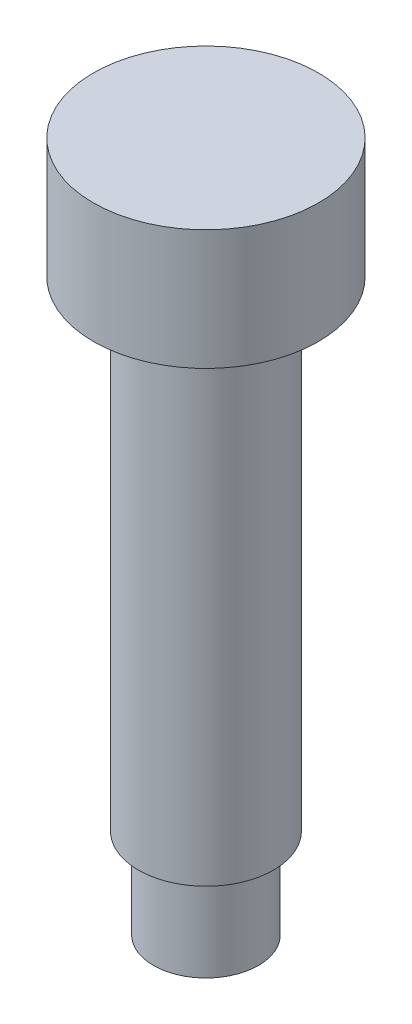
ISO-10303-21;
HEADER;
FILE_DESCRIPTION(('STEP AP214'),'2;1');
FILE_NAME('part.step','',(''),(''),'','','');
FILE_SCHEMA(('AUTOMOTIVE_DESIGN { 1 0 10303 214 1 1 1 1 }'));
ENDSEC;
DATA;
#1=APPLICATION_CONTEXT('core data for automotive mechanical design processes');
#2=APPLICATION_PROTOCOL_DEFINITION('international standard','automotive_design',2000,#1);
#3=PRODUCT_CONTEXT('',#1,'mechanical');
#4=PRODUCT('Part','Part','',(#3));
#5=PRODUCT_RELATED_PRODUCT_CATEGORY('part','',(#4));
#6=PRODUCT_DEFINITION_FORMATION('','',#4);
#7=PRODUCT_DEFINITION_CONTEXT('part definition',#1,'design');
#8=PRODUCT_DEFINITION('design','',#6,#7);
#9=PRODUCT_DEFINITION_SHAPE('','',#8);
#10=(LENGTH_UNIT() NAMED_UNIT(*) SI_UNIT(.MILLI.,.METRE.));
#11=(NAMED_UNIT(*) PLANE_ANGLE_UNIT() SI_UNIT($,.RADIAN.));
#12=(NAMED_UNIT(*) SI_UNIT($,.STERADIAN.) SOLID_ANGLE_UNIT());
#13=UNCERTAINTY_MEASURE_WITH_UNIT(LENGTH_MEASURE(1.E-05),#10,'distance_accuracy_value','');
#14=(GEOMETRIC_REPRESENTATION_CONTEXT(3) GLOBAL_UNCERTAINTY_ASSIGNED_CONTEXT((#13)) GLOBAL_UNIT_ASSIGNED_CONTEXT((#10,
#11,#12)) REPRESENTATION_CONTEXT('',''));
#15=CARTESIAN_POINT('',(0.,0.,0.));
#16=DIRECTION('',(0.,0.,1.));
#17=DIRECTION('',(1.,0.,0.));
#18=AXIS2_PLACEMENT_3D('',#15,#16,#17);
#19=CARTESIAN_POINT('',(1.3890625,0.,0.));
#20=DIRECTION('',(0.,1.,0.));
#21=DIRECTION('',(0.,0.,1.));
#22=AXIS2_PLACEMENT_3D('',#19,#20,#21);
#23=PLANE('',#22);
#24=CARTESIAN_POINT('',(0.,0.,0.));
#25=DIRECTION('',(0.,1.,0.));
#26=DIRECTION('',(0.,0.,1.));
#27=AXIS2_PLACEMENT_3D('',#24,#25,#26);
#28=CIRCLE('',#27,1.3890625);
#29=CARTESIAN_POINT('',(0.,0.,1.3890625));
#30=VERTEX_POINT('',#29);
#31=EDGE_CURVE('E50',#30,#30,#28,.T.);
#32=ORIENTED_EDGE('',*,*,#31,.F.);
#33=EDGE_LOOP('',(#32));
#34=FACE_BOUND('',#33,.T.);
#35=ADVANCED_FACE('F28',(#34),#23,.F.);
#36=CARTESIAN_POINT('',(0.,18.25625,0.));
#37=DIRECTION('',(0.,-1.,0.));
#38=DIRECTION('',(0.,0.,-1.));
#39=AXIS2_PLACEMENT_3D('',#36,#37,#38);
#40=PLANE('',#39);
#41=CARTESIAN_POINT('',(0.,18.25625,0.));
#42=DIRECTION('',(0.,1.,0.));
#43=DIRECTION('',(0.,0.,1.));
#44=AXIS2_PLACEMENT_3D('',#41,#42,#43);
#45=CIRCLE('',#44,2.9765625);
#46=CARTESIAN_POINT('',(0.,18.25625,2.9765625));
#47=VERTEX_POINT('',#46);
#48=EDGE_CURVE('E10',#47,#47,#45,.T.);
#49=ORIENTED_EDGE('',*,*,#48,.T.);
#50=EDGE_LOOP('',(#49));
#51=FACE_BOUND('',#50,.T.);
#52=ADVANCED_FACE('F57',(#51),#40,.F.);
#53=CARTESIAN_POINT('',(0.,0.,0.));
#54=DIRECTION('',(0.,1.,0.));
#55=DIRECTION('',(0.,0.,1.));
#56=AXIS2_PLACEMENT_3D('',#53,#54,#55);
#57=CYLINDRICAL_SURFACE('',#56,2.9765625);
#58=ORIENTED_EDGE('',*,*,#48,.F.);
#59=EDGE_LOOP('',(#58));
#60=FACE_BOUND('',#59,.T.);
#61=CARTESIAN_POINT('',(0.,15.08125,0.));
#62=DIRECTION('',(0.,1.,0.));
#63=DIRECTION('',(0.,0.,1.));
#64=AXIS2_PLACEMENT_3D('',#61,#62,#63);
#65=CIRCLE('',#64,2.9765625);
#66=CARTESIAN_POINT('',(0.,15.08125,2.9765625));
#67=VERTEX_POINT('',#66);
#68=EDGE_CURVE('E34',#67,#67,#65,.T.);
#69=ORIENTED_EDGE('',*,*,#68,.T.);
#70=EDGE_LOOP('',(#69));
#71=FACE_BOUND('',#70,.T.);
#72=ADVANCED_FACE('F61',(#60,#71),#57,.T.);
#73=CARTESIAN_POINT('',(2.9765625,15.08125,0.));
#74=DIRECTION('',(0.,1.,0.));
#75=DIRECTION('',(0.,0.,1.));
#76=AXIS2_PLACEMENT_3D('',#73,#74,#75);
#77=PLANE('',#76);
#78=ORIENTED_EDGE('',*,*,#68,.F.);
#79=EDGE_LOOP('',(#78));
#80=FACE_BOUND('',#79,.T.);
#81=CARTESIAN_POINT('',(0.,15.08125,0.));
#82=DIRECTION('',(0.,1.,0.));
#83=DIRECTION('',(0.,0.,1.));
#84=AXIS2_PLACEMENT_3D('',#81,#82,#83);
#85=CIRCLE('',#84,1.7859375);
#86=CARTESIAN_POINT('',(0.,15.08125,1.7859375));
#87=VERTEX_POINT('',#86);
#88=EDGE_CURVE('E38',#87,#87,#85,.T.);
#89=ORIENTED_EDGE('',*,*,#88,.T.);
#90=EDGE_LOOP('',(#89));
#91=FACE_BOUND('',#90,.T.);
#92=ADVANCED_FACE('F65',(#80,#91),#77,.F.);
#93=CARTESIAN_POINT('',(0.,0.,0.));
#94=DIRECTION('',(0.,1.,0.));
#95=DIRECTION('',(0.,0.,1.));
#96=AXIS2_PLACEMENT_3D('',#93,#94,#95);
#97=CYLINDRICAL_SURFACE('',#96,1.7859375);
#98=ORIENTED_EDGE('',*,*,#88,.F.);
#99=EDGE_LOOP('',(#98));
#100=FACE_BOUND('',#99,.T.);
#101=CARTESIAN_POINT('',(0.,2.38125,0.));
#102=DIRECTION('',(0.,1.,0.));
#103=DIRECTION('',(0.,0.,1.));
#104=AXIS2_PLACEMENT_3D('',#101,#102,#103);
#105=CIRCLE('',#104,1.7859375);
#106=CARTESIAN_POINT('',(0.,2.38125,1.7859375));
#107=VERTEX_POINT('',#106);
#108=EDGE_CURVE('E42',#107,#107,#105,.T.);
#109=ORIENTED_EDGE('',*,*,#108,.T.);
#110=EDGE_LOOP('',(#109));
#111=FACE_BOUND('',#110,.T.);
#112=ADVANCED_FACE('F71',(#100,#111),#97,.T.);
#113=CARTESIAN_POINT('',(1.7859375,2.38125,0.));
#114=DIRECTION('',(0.,1.,0.));
#115=DIRECTION('',(0.,0.,1.));
#116=AXIS2_PLACEMENT_3D('',#113,#114,#115);
#117=PLANE('',#116);
#118=ORIENTED_EDGE('',*,*,#108,.F.);
#119=EDGE_LOOP('',(#118));
#120=FACE_BOUND('',#119,.T.);
#121=CARTESIAN_POINT('',(0.,2.38125,0.));
#122=DIRECTION('',(0.,1.,0.));
#123=DIRECTION('',(0.,0.,1.));
#124=AXIS2_PLACEMENT_3D('',#121,#122,#123);
#125=CIRCLE('',#124,1.3890625);
#126=CARTESIAN_POINT('',(0.,2.38125,1.3890625));
#127=VERTEX_POINT('',#126);
#128=EDGE_CURVE('E47',#127,#127,#125,.T.);
#129=ORIENTED_EDGE('',*,*,#128,.T.);
#130=EDGE_LOOP('',(#129));
#131=FACE_BOUND('',#130,.T.);
#132=ADVANCED_FACE('F75',(#120,#131),#117,.F.);
#133=CARTESIAN_POINT('',(0.,0.,0.));
#134=DIRECTION('',(0.,1.,0.));
#135=DIRECTION('',(0.,0.,1.));
#136=AXIS2_PLACEMENT_3D('',#133,#134,#135);
#137=CYLINDRICAL_SURFACE('',#136,1.3890625);
#138=ORIENTED_EDGE('',*,*,#128,.F.);
#139=EDGE_LOOP('',(#138));
#140=FACE_BOUND('',#139,.T.);
#141=ORIENTED_EDGE('',*,*,#31,.T.);
#142=EDGE_LOOP('',(#141));
#143=FACE_BOUND('',#142,.T.);
#144=ADVANCED_FACE('F54',(#140,#143),#137,.T.);
#145=CLOSED_SHELL('',(#35,#52,#72,#92,#112,#132,#144));
#146=MANIFOLD_SOLID_BREP('B2',#145);
#147=ADVANCED_BREP_SHAPE_REPRESENTATION('',(#18,#146),#14);
#148=SHAPE_DEFINITION_REPRESENTATION(#9,#147);
ENDSEC;
END-ISO-10303-21;
